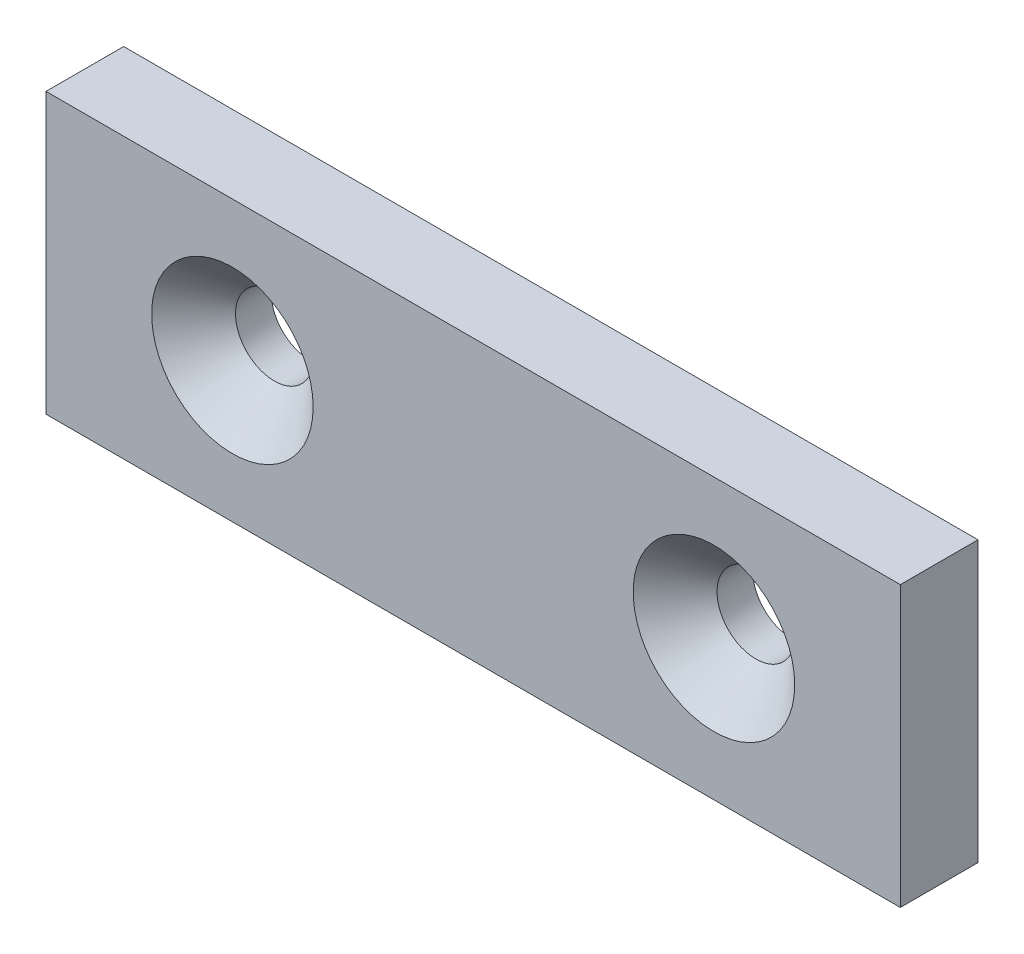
ISO-10303-21;
HEADER;
FILE_DESCRIPTION(('STEP AP214'),'2;1');
FILE_NAME('part.step','',(''),(''),'','','');
FILE_SCHEMA(('AUTOMOTIVE_DESIGN { 1 0 10303 214 1 1 1 1 }'));
ENDSEC;
DATA;
#1=APPLICATION_CONTEXT('core data for automotive mechanical design processes');
#2=APPLICATION_PROTOCOL_DEFINITION('international standard','automotive_design',2000,#1);
#3=PRODUCT_CONTEXT('',#1,'mechanical');
#4=PRODUCT('Part','Part','',(#3));
#5=PRODUCT_RELATED_PRODUCT_CATEGORY('part','',(#4));
#6=PRODUCT_DEFINITION_FORMATION('','',#4);
#7=PRODUCT_DEFINITION_CONTEXT('part definition',#1,'design');
#8=PRODUCT_DEFINITION('design','',#6,#7);
#9=PRODUCT_DEFINITION_SHAPE('','',#8);
#10=(LENGTH_UNIT() NAMED_UNIT(*) SI_UNIT(.MILLI.,.METRE.));
#11=(NAMED_UNIT(*) PLANE_ANGLE_UNIT() SI_UNIT($,.RADIAN.));
#12=(NAMED_UNIT(*) SI_UNIT($,.STERADIAN.) SOLID_ANGLE_UNIT());
#13=UNCERTAINTY_MEASURE_WITH_UNIT(LENGTH_MEASURE(1.E-05),#10,'distance_accuracy_value','');
#14=(GEOMETRIC_REPRESENTATION_CONTEXT(3) GLOBAL_UNCERTAINTY_ASSIGNED_CONTEXT((#13)) GLOBAL_UNIT_ASSIGNED_CONTEXT((#10,
#11,#12)) REPRESENTATION_CONTEXT('',''));
#15=CARTESIAN_POINT('',(0.,0.,0.));
#16=DIRECTION('',(0.,0.,1.));
#17=DIRECTION('',(1.,0.,0.));
#18=AXIS2_PLACEMENT_3D('',#15,#16,#17);
#19=CARTESIAN_POINT('',(0.,0.,5.));
#20=DIRECTION('',(1.,0.,0.));
#21=DIRECTION('',(0.,0.,-1.));
#22=AXIS2_PLACEMENT_3D('',#19,#20,#21);
#23=PLANE('',#22);
#24=DIRECTION('',(0.,-1.,0.));
#25=VECTOR('',#24,1.);
#26=CARTESIAN_POINT('',(0.,0.,0.));
#27=LINE('',#26,#25);
#28=CARTESIAN_POINT('',(0.,18.,0.));
#29=VERTEX_POINT('',#28);
#30=CARTESIAN_POINT('',(0.,0.,0.));
#31=VERTEX_POINT('',#30);
#32=EDGE_CURVE('E97',#29,#31,#27,.T.);
#33=ORIENTED_EDGE('',*,*,#32,.T.);
#34=DIRECTION('',(0.,0.,-1.));
#35=VECTOR('',#34,1.);
#36=CARTESIAN_POINT('',(0.,0.,5.));
#37=LINE('',#36,#35);
#38=CARTESIAN_POINT('',(0.,0.,5.));
#39=VERTEX_POINT('',#38);
#40=EDGE_CURVE('E11',#39,#31,#37,.T.);
#41=ORIENTED_EDGE('',*,*,#40,.F.);
#42=DIRECTION('',(0.,-1.,0.));
#43=VECTOR('',#42,1.);
#44=CARTESIAN_POINT('',(0.,0.,5.));
#45=LINE('',#44,#43);
#46=CARTESIAN_POINT('',(0.,18.,5.));
#47=VERTEX_POINT('',#46);
#48=EDGE_CURVE('E85',#47,#39,#45,.T.);
#49=ORIENTED_EDGE('',*,*,#48,.F.);
#50=DIRECTION('',(0.,0.,-1.));
#51=VECTOR('',#50,1.);
#52=CARTESIAN_POINT('',(0.,18.,5.));
#53=LINE('',#52,#51);
#54=EDGE_CURVE('E93',#47,#29,#53,.T.);
#55=ORIENTED_EDGE('',*,*,#54,.T.);
#56=EDGE_LOOP('',(#33,#41,#49,#55));
#57=FACE_BOUND('',#56,.T.);
#58=ADVANCED_FACE('F34',(#57),#23,.F.);
#59=CARTESIAN_POINT('',(0.,0.,5.));
#60=DIRECTION('',(0.,1.,0.));
#61=DIRECTION('',(0.,0.,1.));
#62=AXIS2_PLACEMENT_3D('',#59,#60,#61);
#63=PLANE('',#62);
#64=DIRECTION('',(1.,0.,0.));
#65=VECTOR('',#64,1.);
#66=CARTESIAN_POINT('',(0.,0.,0.));
#67=LINE('',#66,#65);
#68=CARTESIAN_POINT('',(55.,0.,0.));
#69=VERTEX_POINT('',#68);
#70=EDGE_CURVE('E89',#31,#69,#67,.T.);
#71=ORIENTED_EDGE('',*,*,#70,.T.);
#72=DIRECTION('',(0.,0.,-1.));
#73=VECTOR('',#72,1.);
#74=CARTESIAN_POINT('',(55.,0.,5.));
#75=LINE('',#74,#73);
#76=CARTESIAN_POINT('',(55.,0.,5.));
#77=VERTEX_POINT('',#76);
#78=EDGE_CURVE('E42',#77,#69,#75,.T.);
#79=ORIENTED_EDGE('',*,*,#78,.F.);
#80=DIRECTION('',(1.,0.,0.));
#81=VECTOR('',#80,1.);
#82=CARTESIAN_POINT('',(0.,0.,5.));
#83=LINE('',#82,#81);
#84=EDGE_CURVE('E80',#39,#77,#83,.T.);
#85=ORIENTED_EDGE('',*,*,#84,.F.);
#86=ORIENTED_EDGE('',*,*,#40,.T.);
#87=EDGE_LOOP('',(#71,#79,#85,#86));
#88=FACE_BOUND('',#87,.T.);
#89=ADVANCED_FACE('F88',(#88),#63,.F.);
#90=CARTESIAN_POINT('',(55.,0.,5.));
#91=DIRECTION('',(-1.,0.,0.));
#92=DIRECTION('',(0.,0.,1.));
#93=AXIS2_PLACEMENT_3D('',#90,#91,#92);
#94=PLANE('',#93);
#95=DIRECTION('',(0.,1.,0.));
#96=VECTOR('',#95,1.);
#97=CARTESIAN_POINT('',(55.,0.,0.));
#98=LINE('',#97,#96);
#99=CARTESIAN_POINT('',(55.,18.,0.));
#100=VERTEX_POINT('',#99);
#101=EDGE_CURVE('E67',#69,#100,#98,.T.);
#102=ORIENTED_EDGE('',*,*,#101,.T.);
#103=DIRECTION('',(0.,0.,-1.));
#104=VECTOR('',#103,1.);
#105=CARTESIAN_POINT('',(55.,18.,5.));
#106=LINE('',#105,#104);
#107=CARTESIAN_POINT('',(55.,18.,5.));
#108=VERTEX_POINT('',#107);
#109=EDGE_CURVE('E90',#108,#100,#106,.T.);
#110=ORIENTED_EDGE('',*,*,#109,.F.);
#111=DIRECTION('',(0.,1.,0.));
#112=VECTOR('',#111,1.);
#113=CARTESIAN_POINT('',(55.,0.,5.));
#114=LINE('',#113,#112);
#115=EDGE_CURVE('E83',#77,#108,#114,.T.);
#116=ORIENTED_EDGE('',*,*,#115,.F.);
#117=ORIENTED_EDGE('',*,*,#78,.T.);
#118=EDGE_LOOP('',(#102,#110,#116,#117));
#119=FACE_BOUND('',#118,.T.);
#120=ADVANCED_FACE('F91',(#119),#94,.F.);
#121=CARTESIAN_POINT('',(0.,18.,5.));
#122=DIRECTION('',(0.,-1.,0.));
#123=DIRECTION('',(0.,0.,-1.));
#124=AXIS2_PLACEMENT_3D('',#121,#122,#123);
#125=PLANE('',#124);
#126=DIRECTION('',(-1.,0.,0.));
#127=VECTOR('',#126,1.);
#128=CARTESIAN_POINT('',(0.,18.,0.));
#129=LINE('',#128,#127);
#130=EDGE_CURVE('E73',#100,#29,#129,.T.);
#131=ORIENTED_EDGE('',*,*,#130,.T.);
#132=ORIENTED_EDGE('',*,*,#54,.F.);
#133=DIRECTION('',(-1.,0.,0.));
#134=VECTOR('',#133,1.);
#135=CARTESIAN_POINT('',(0.,18.,5.));
#136=LINE('',#135,#134);
#137=EDGE_CURVE('E50',#108,#47,#136,.T.);
#138=ORIENTED_EDGE('',*,*,#137,.F.);
#139=ORIENTED_EDGE('',*,*,#109,.T.);
#140=EDGE_LOOP('',(#131,#132,#138,#139));
#141=FACE_BOUND('',#140,.T.);
#142=ADVANCED_FACE('F105',(#141),#125,.F.);
#143=CARTESIAN_POINT('',(0.,0.,5.));
#144=DIRECTION('',(0.,0.,-1.));
#145=DIRECTION('',(-1.,0.,0.));
#146=AXIS2_PLACEMENT_3D('',#143,#144,#145);
#147=PLANE('',#146);
#148=CARTESIAN_POINT('',(12.,9.,5.));
#149=DIRECTION('',(0.,0.,1.));
#150=DIRECTION('',(1.,0.,0.));
#151=AXIS2_PLACEMENT_3D('',#148,#149,#150);
#152=CIRCLE('',#151,5.2);
#153=CARTESIAN_POINT('',(17.2,9.,5.));
#154=VERTEX_POINT('',#153);
#155=EDGE_CURVE('E125',#154,#154,#152,.T.);
#156=ORIENTED_EDGE('',*,*,#155,.F.);
#157=EDGE_LOOP('',(#156));
#158=FACE_BOUND('',#157,.T.);
#159=CARTESIAN_POINT('',(43.,9.,5.));
#160=DIRECTION('',(0.,0.,1.));
#161=DIRECTION('',(1.,0.,0.));
#162=AXIS2_PLACEMENT_3D('',#159,#160,#161);
#163=CIRCLE('',#162,5.2);
#164=CARTESIAN_POINT('',(48.2,9.,5.));
#165=VERTEX_POINT('',#164);
#166=EDGE_CURVE('E116',#165,#165,#163,.T.);
#167=ORIENTED_EDGE('',*,*,#166,.F.);
#168=EDGE_LOOP('',(#167));
#169=FACE_BOUND('',#168,.T.);
#170=ORIENTED_EDGE('',*,*,#48,.T.);
#171=ORIENTED_EDGE('',*,*,#84,.T.);
#172=ORIENTED_EDGE('',*,*,#115,.T.);
#173=ORIENTED_EDGE('',*,*,#137,.T.);
#174=EDGE_LOOP('',(#170,#171,#172,#173));
#175=FACE_BOUND('',#174,.T.);
#176=ADVANCED_FACE('F81',(#158,#169,#175),#147,.F.);
#177=CARTESIAN_POINT('',(0.,0.,0.));
#178=DIRECTION('',(0.,0.,-1.));
#179=DIRECTION('',(-1.,0.,0.));
#180=AXIS2_PLACEMENT_3D('',#177,#178,#179);
#181=PLANE('',#180);
#182=CARTESIAN_POINT('',(12.,9.,0.));
#183=DIRECTION('',(0.,0.,1.));
#184=DIRECTION('',(1.,0.,0.));
#185=AXIS2_PLACEMENT_3D('',#182,#183,#184);
#186=CIRCLE('',#185,2.5);
#187=CARTESIAN_POINT('',(14.5,9.,0.));
#188=VERTEX_POINT('',#187);
#189=EDGE_CURVE('E119',#188,#188,#186,.T.);
#190=ORIENTED_EDGE('',*,*,#189,.T.);
#191=EDGE_LOOP('',(#190));
#192=FACE_BOUND('',#191,.T.);
#193=CARTESIAN_POINT('',(43.,9.,0.));
#194=DIRECTION('',(0.,0.,1.));
#195=DIRECTION('',(1.,0.,0.));
#196=AXIS2_PLACEMENT_3D('',#193,#194,#195);
#197=CIRCLE('',#196,2.5);
#198=CARTESIAN_POINT('',(45.5,9.,0.));
#199=VERTEX_POINT('',#198);
#200=EDGE_CURVE('E100',#199,#199,#197,.T.);
#201=ORIENTED_EDGE('',*,*,#200,.T.);
#202=EDGE_LOOP('',(#201));
#203=FACE_BOUND('',#202,.T.);
#204=ORIENTED_EDGE('',*,*,#32,.F.);
#205=ORIENTED_EDGE('',*,*,#130,.F.);
#206=ORIENTED_EDGE('',*,*,#101,.F.);
#207=ORIENTED_EDGE('',*,*,#70,.F.);
#208=EDGE_LOOP('',(#204,#205,#206,#207));
#209=FACE_BOUND('',#208,.T.);
#210=ADVANCED_FACE('F108',(#192,#203,#209),#181,.T.);
#211=CARTESIAN_POINT('',(43.,9.,5.));
#212=DIRECTION('',(0.,0.,1.));
#213=DIRECTION('',(1.,0.,0.));
#214=AXIS2_PLACEMENT_3D('',#211,#212,#213);
#215=CYLINDRICAL_SURFACE('',#214,2.5);
#216=ORIENTED_EDGE('',*,*,#200,.F.);
#217=EDGE_LOOP('',(#216));
#218=FACE_BOUND('',#217,.T.);
#219=CARTESIAN_POINT('',(43.,9.,2.3));
#220=DIRECTION('',(0.,0.,1.));
#221=DIRECTION('',(1.,0.,0.));
#222=AXIS2_PLACEMENT_3D('',#219,#220,#221);
#223=CIRCLE('',#222,2.5);
#224=CARTESIAN_POINT('',(45.5,9.,2.3));
#225=VERTEX_POINT('',#224);
#226=EDGE_CURVE('E113',#225,#225,#223,.T.);
#227=ORIENTED_EDGE('',*,*,#226,.T.);
#228=EDGE_LOOP('',(#227));
#229=FACE_BOUND('',#228,.T.);
#230=ADVANCED_FACE('F139',(#218,#229),#215,.F.);
#231=CARTESIAN_POINT('',(43.,9.,5.));
#232=DIRECTION('',(0.,0.,1.));
#233=DIRECTION('',(1.,0.,0.));
#234=AXIS2_PLACEMENT_3D('',#231,#232,#233);
#235=CONICAL_SURFACE('',#234,5.2,0.785398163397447);
#236=ORIENTED_EDGE('',*,*,#226,.F.);
#237=EDGE_LOOP('',(#236));
#238=FACE_BOUND('',#237,.T.);
#239=ORIENTED_EDGE('',*,*,#166,.T.);
#240=EDGE_LOOP('',(#239));
#241=FACE_BOUND('',#240,.T.);
#242=ADVANCED_FACE('F136',(#238,#241),#235,.F.);
#243=CARTESIAN_POINT('',(12.,9.,5.));
#244=DIRECTION('',(0.,0.,1.));
#245=DIRECTION('',(1.,0.,0.));
#246=AXIS2_PLACEMENT_3D('',#243,#244,#245);
#247=CYLINDRICAL_SURFACE('',#246,2.5);
#248=ORIENTED_EDGE('',*,*,#189,.F.);
#249=EDGE_LOOP('',(#248));
#250=FACE_BOUND('',#249,.T.);
#251=CARTESIAN_POINT('',(12.,9.,2.3));
#252=DIRECTION('',(0.,0.,1.));
#253=DIRECTION('',(1.,0.,0.));
#254=AXIS2_PLACEMENT_3D('',#251,#252,#253);
#255=CIRCLE('',#254,2.5);
#256=CARTESIAN_POINT('',(14.5,9.,2.3));
#257=VERTEX_POINT('',#256);
#258=EDGE_CURVE('E122',#257,#257,#255,.T.);
#259=ORIENTED_EDGE('',*,*,#258,.T.);
#260=EDGE_LOOP('',(#259));
#261=FACE_BOUND('',#260,.T.);
#262=ADVANCED_FACE('F138',(#250,#261),#247,.F.);
#263=CARTESIAN_POINT('',(12.,9.,5.));
#264=DIRECTION('',(0.,0.,1.));
#265=DIRECTION('',(1.,0.,0.));
#266=AXIS2_PLACEMENT_3D('',#263,#264,#265);
#267=CONICAL_SURFACE('',#266,5.2,0.785398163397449);
#268=ORIENTED_EDGE('',*,*,#258,.F.);
#269=EDGE_LOOP('',(#268));
#270=FACE_BOUND('',#269,.T.);
#271=ORIENTED_EDGE('',*,*,#155,.T.);
#272=EDGE_LOOP('',(#271));
#273=FACE_BOUND('',#272,.T.);
#274=ADVANCED_FACE('F129',(#270,#273),#267,.F.);
#275=CLOSED_SHELL('',(#58,#89,#120,#142,#176,#210,#230,#242,#262,#274));
#276=MANIFOLD_SOLID_BREP('B2',#275);
#277=ADVANCED_BREP_SHAPE_REPRESENTATION('',(#18,#276),#14);
#278=SHAPE_DEFINITION_REPRESENTATION(#9,#277);
ENDSEC;
END-ISO-10303-21;
